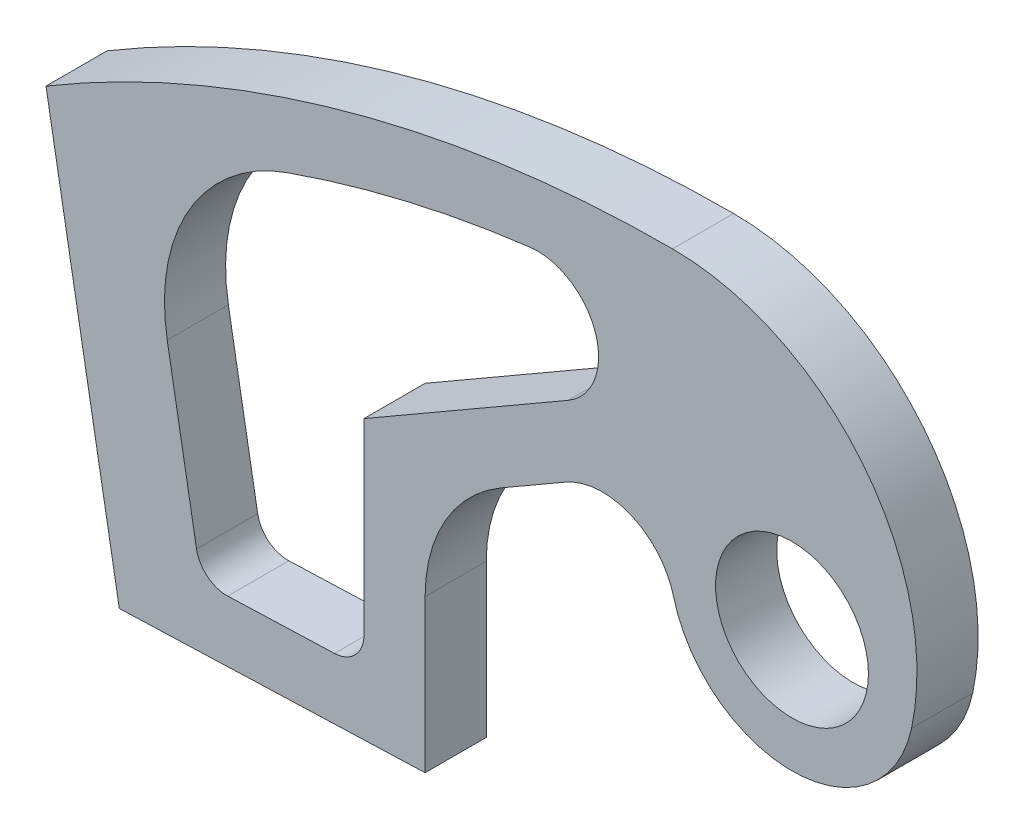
from build123d import *

# Parameters (mm, degrees)
BOSS_EXTRU_1_DEPTH      = 10
ESQUISSE2_R             = 12.5
ENL_V_MAT_EXTRU_1_DEPTH = 10


with BuildPart() as part:
    # Esquisse1 → Boss.-Extru.1 (new body)
    with BuildSketch(Plane.XY):
        with BuildLine():
            Line((0, 0), (-11.990234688, 68))
            ThreePointArc((-11.990234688, 68), (37.334675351, 89.019946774), (90.471384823, 96.180604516))
            ThreePointArc((90.471384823, 96.180604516), (121.55803946, 81.327942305), (129.567947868, 47.819390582))
            ThreePointArc((129.567947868, 47.819390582), (110.429443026, 32.004403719), (90.644218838, 47.00243962))
            ThreePointArc((90.644218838, 47.00243962), (83.659210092, 55.079612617), (73.001954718, 54.40583319))
            Line((73.001954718, 54.40583319), (62.509765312, 48.348164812))
            ThreePointArc((62.509765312, 48.348164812), (53.359130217, 39.197529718), (50.009765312, 26.697529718))
            Line((50.009765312, 26.697529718), (50.009765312, 1.746379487))
            Line((50.009765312, 1.746379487), (0, 0))
        make_face()
        with BuildLine():
            Line((17.728424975, 10.625185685), (35.184262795, 11.234756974))
            ThreePointArc((35.184262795, 11.234756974), (38.606464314, 12.758419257), (40.009765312, 16.231711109))
            Line((40.009765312, 16.231711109), (40.009765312, 46.904789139))
            Line((40.009765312, 46.904789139), (73.381557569, 66.172002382))
            ThreePointArc((73.381557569, 66.172002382), (77.864311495, 78.006745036), (67.159845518, 84.757346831))
            ThreePointArc((67.159845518, 84.757346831), (47.051782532, 81.176105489), (27.44431777, 75.457118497))
            ThreePointArc((27.44431777, 75.457118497), (11.486171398, 62.299321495), (7.836094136, 41.94085904))
            Line((7.836094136, 41.94085904), (12.629888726, 14.753898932))
            ThreePointArc((12.629888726, 14.753898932), (14.407325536, 11.736410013), (17.728424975, 10.625185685))
        make_face(mode=Mode.SUBTRACT)
    extrude(amount=BOSS_EXTRU_1_DEPTH)

    # Esquisse2 → Enl_v. mat.-Extru.1 (cut)
    with BuildSketch(Plane.XY.offset(10)):
        with Locations((110.009765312, 52)):
            Circle(ESQUISSE2_R)
    extrude(amount=-ENL_V_MAT_EXTRU_1_DEPTH, mode=Mode.SUBTRACT)


solid = part.part
